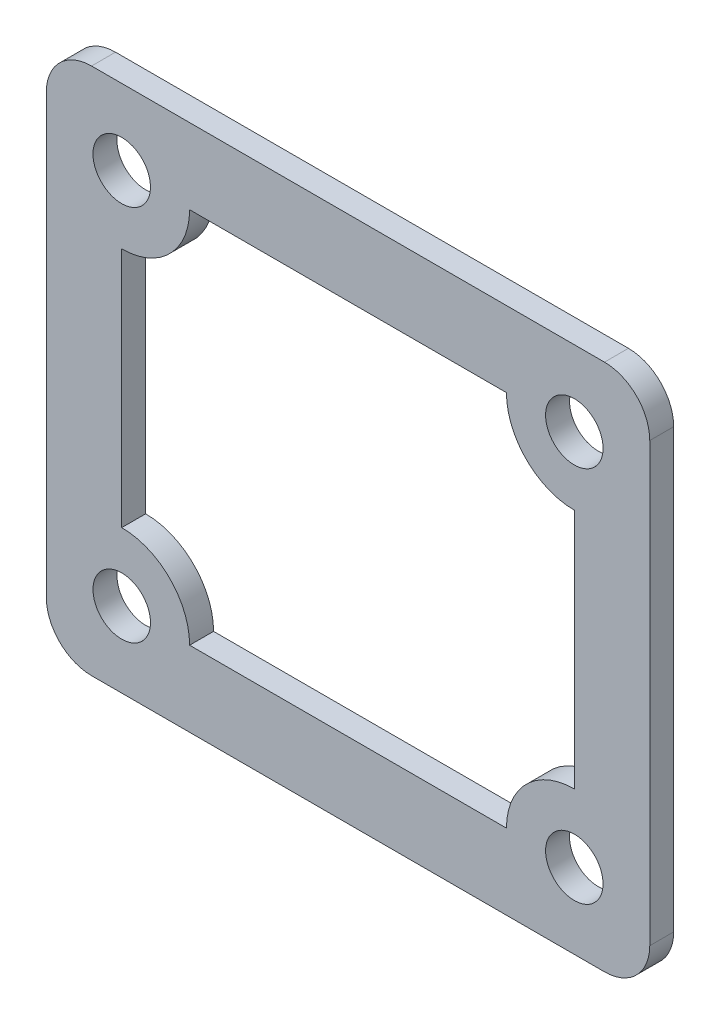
ISO-10303-21;
HEADER;
FILE_DESCRIPTION(('STEP AP214'),'2;1');
FILE_NAME('part.step','',(''),(''),'','','');
FILE_SCHEMA(('AUTOMOTIVE_DESIGN { 1 0 10303 214 1 1 1 1 }'));
ENDSEC;
DATA;
#1=APPLICATION_CONTEXT('core data for automotive mechanical design processes');
#2=APPLICATION_PROTOCOL_DEFINITION('international standard','automotive_design',2000,#1);
#3=PRODUCT_CONTEXT('',#1,'mechanical');
#4=PRODUCT('Part','Part','',(#3));
#5=PRODUCT_RELATED_PRODUCT_CATEGORY('part','',(#4));
#6=PRODUCT_DEFINITION_FORMATION('','',#4);
#7=PRODUCT_DEFINITION_CONTEXT('part definition',#1,'design');
#8=PRODUCT_DEFINITION('design','',#6,#7);
#9=PRODUCT_DEFINITION_SHAPE('','',#8);
#10=(LENGTH_UNIT() NAMED_UNIT(*) SI_UNIT(.MILLI.,.METRE.));
#11=(NAMED_UNIT(*) PLANE_ANGLE_UNIT() SI_UNIT($,.RADIAN.));
#12=(NAMED_UNIT(*) SI_UNIT($,.STERADIAN.) SOLID_ANGLE_UNIT());
#13=UNCERTAINTY_MEASURE_WITH_UNIT(LENGTH_MEASURE(1.E-05),#10,'distance_accuracy_value','');
#14=(GEOMETRIC_REPRESENTATION_CONTEXT(3) GLOBAL_UNCERTAINTY_ASSIGNED_CONTEXT((#13)) GLOBAL_UNIT_ASSIGNED_CONTEXT((#10,
#11,#12)) REPRESENTATION_CONTEXT('',''));
#15=CARTESIAN_POINT('',(0.,0.,0.));
#16=DIRECTION('',(0.,0.,1.));
#17=DIRECTION('',(1.,0.,0.));
#18=AXIS2_PLACEMENT_3D('',#15,#16,#17);
#19=CARTESIAN_POINT('',(0.,0.,1.5875));
#20=DIRECTION('',(0.,0.,1.));
#21=DIRECTION('',(1.,0.,0.));
#22=AXIS2_PLACEMENT_3D('',#19,#20,#21);
#23=PLANE('',#22);
#24=CARTESIAN_POINT('',(15.,12.5,1.5875));
#25=DIRECTION('',(0.,0.,1.));
#26=DIRECTION('',(1.,0.,0.));
#27=AXIS2_PLACEMENT_3D('',#24,#25,#26);
#28=CIRCLE('',#27,1.905);
#29=CARTESIAN_POINT('',(16.905,12.5,1.5875));
#30=VERTEX_POINT('',#29);
#31=EDGE_CURVE('E257',#30,#30,#28,.T.);
#32=ORIENTED_EDGE('',*,*,#31,.F.);
#33=EDGE_LOOP('',(#32));
#34=FACE_BOUND('',#33,.T.);
#35=CARTESIAN_POINT('',(15.,-12.5,1.5875));
#36=DIRECTION('',(0.,0.,1.));
#37=DIRECTION('',(-1.,0.,0.));
#38=AXIS2_PLACEMENT_3D('',#35,#36,#37);
#39=CIRCLE('',#38,1.905);
#40=CARTESIAN_POINT('',(13.095,-12.5,1.5875));
#41=VERTEX_POINT('',#40);
#42=EDGE_CURVE('E273',#41,#41,#39,.T.);
#43=ORIENTED_EDGE('',*,*,#42,.F.);
#44=EDGE_LOOP('',(#43));
#45=FACE_BOUND('',#44,.T.);
#46=DIRECTION('',(0.,1.,0.));
#47=VECTOR('',#46,1.);
#48=CARTESIAN_POINT('',(20.,17.5,1.5875));
#49=LINE('',#48,#47);
#50=CARTESIAN_POINT('',(20.,-14.5,1.5875));
#51=VERTEX_POINT('',#50);
#52=CARTESIAN_POINT('',(20.,14.5,1.5875));
#53=VERTEX_POINT('',#52);
#54=EDGE_CURVE('E281',#51,#53,#49,.T.);
#55=ORIENTED_EDGE('',*,*,#54,.T.);
#56=CARTESIAN_POINT('',(17.,14.5,1.5875));
#57=DIRECTION('',(0.,0.,1.));
#58=DIRECTION('',(1.,0.,0.));
#59=AXIS2_PLACEMENT_3D('',#56,#57,#58);
#60=CIRCLE('',#59,3.);
#61=CARTESIAN_POINT('',(17.,17.5,1.5875));
#62=VERTEX_POINT('',#61);
#63=EDGE_CURVE('E343',#53,#62,#60,.T.);
#64=ORIENTED_EDGE('',*,*,#63,.T.);
#65=DIRECTION('',(-1.,0.,0.));
#66=VECTOR('',#65,1.);
#67=CARTESIAN_POINT('',(-20.,17.5,1.5875));
#68=LINE('',#67,#66);
#69=CARTESIAN_POINT('',(-17.,17.5,1.5875));
#70=VERTEX_POINT('',#69);
#71=EDGE_CURVE('E285',#62,#70,#68,.T.);
#72=ORIENTED_EDGE('',*,*,#71,.T.);
#73=CARTESIAN_POINT('',(-17.,14.5,1.5875));
#74=DIRECTION('',(0.,0.,1.));
#75=DIRECTION('',(1.,0.,0.));
#76=AXIS2_PLACEMENT_3D('',#73,#74,#75);
#77=CIRCLE('',#76,3.);
#78=CARTESIAN_POINT('',(-20.,14.5,1.5875));
#79=VERTEX_POINT('',#78);
#80=EDGE_CURVE('E340',#70,#79,#77,.T.);
#81=ORIENTED_EDGE('',*,*,#80,.T.);
#82=DIRECTION('',(0.,-1.,0.));
#83=VECTOR('',#82,1.);
#84=CARTESIAN_POINT('',(-20.,17.5,1.5875));
#85=LINE('',#84,#83);
#86=CARTESIAN_POINT('',(-20.,-14.5,1.5875));
#87=VERTEX_POINT('',#86);
#88=EDGE_CURVE('E290',#79,#87,#85,.T.);
#89=ORIENTED_EDGE('',*,*,#88,.T.);
#90=CARTESIAN_POINT('',(-17.,-14.5,1.5875));
#91=DIRECTION('',(0.,0.,1.));
#92=DIRECTION('',(1.,0.,0.));
#93=AXIS2_PLACEMENT_3D('',#90,#91,#92);
#94=CIRCLE('',#93,3.);
#95=CARTESIAN_POINT('',(-17.,-17.5,1.5875));
#96=VERTEX_POINT('',#95);
#97=EDGE_CURVE('E61',#87,#96,#94,.T.);
#98=ORIENTED_EDGE('',*,*,#97,.T.);
#99=DIRECTION('',(1.,0.,0.));
#100=VECTOR('',#99,1.);
#101=CARTESIAN_POINT('',(-20.,-17.5,1.5875));
#102=LINE('',#101,#100);
#103=CARTESIAN_POINT('',(17.,-17.5,1.5875));
#104=VERTEX_POINT('',#103);
#105=EDGE_CURVE('E293',#96,#104,#102,.T.);
#106=ORIENTED_EDGE('',*,*,#105,.T.);
#107=CARTESIAN_POINT('',(17.,-14.5,1.5875));
#108=DIRECTION('',(0.,0.,1.));
#109=DIRECTION('',(1.,0.,0.));
#110=AXIS2_PLACEMENT_3D('',#107,#108,#109);
#111=CIRCLE('',#110,3.);
#112=EDGE_CURVE('E335',#104,#51,#111,.T.);
#113=ORIENTED_EDGE('',*,*,#112,.T.);
#114=EDGE_LOOP('',(#55,#64,#72,#81,#89,#98,#106,#113));
#115=FACE_BOUND('',#114,.T.);
#116=CARTESIAN_POINT('',(-15.,-12.5,1.5875));
#117=DIRECTION('',(0.,0.,1.));
#118=DIRECTION('',(1.,0.,0.));
#119=AXIS2_PLACEMENT_3D('',#116,#117,#118);
#120=CIRCLE('',#119,1.905);
#121=CARTESIAN_POINT('',(-13.095,-12.5,1.5875));
#122=VERTEX_POINT('',#121);
#123=EDGE_CURVE('E265',#122,#122,#120,.T.);
#124=ORIENTED_EDGE('',*,*,#123,.F.);
#125=EDGE_LOOP('',(#124));
#126=FACE_BOUND('',#125,.T.);
#127=CARTESIAN_POINT('',(-15.,12.5,1.5875));
#128=DIRECTION('',(0.,0.,1.));
#129=DIRECTION('',(-1.,0.,0.));
#130=AXIS2_PLACEMENT_3D('',#127,#128,#129);
#131=CIRCLE('',#130,1.905);
#132=CARTESIAN_POINT('',(-16.905,12.5,1.5875));
#133=VERTEX_POINT('',#132);
#134=EDGE_CURVE('E249',#133,#133,#131,.T.);
#135=ORIENTED_EDGE('',*,*,#134,.F.);
#136=EDGE_LOOP('',(#135));
#137=FACE_BOUND('',#136,.T.);
#138=DIRECTION('',(1.,0.,0.));
#139=VECTOR('',#138,1.);
#140=CARTESIAN_POINT('',(10.5,-12.5,1.5875));
#141=LINE('',#140,#139);
#142=CARTESIAN_POINT('',(-10.5,-12.5,1.5875));
#143=VERTEX_POINT('',#142);
#144=CARTESIAN_POINT('',(10.5,-12.5,1.5875));
#145=VERTEX_POINT('',#144);
#146=EDGE_CURVE('E166',#143,#145,#141,.T.);
#147=ORIENTED_EDGE('',*,*,#146,.F.);
#148=CARTESIAN_POINT('',(-15.,-12.5,1.5875));
#149=DIRECTION('',(0.,0.,-1.));
#150=DIRECTION('',(1.,0.,0.));
#151=AXIS2_PLACEMENT_3D('',#148,#149,#150);
#152=CIRCLE('',#151,4.5);
#153=CARTESIAN_POINT('',(-15.,-8.,1.5875));
#154=VERTEX_POINT('',#153);
#155=EDGE_CURVE('E155',#154,#143,#152,.T.);
#156=ORIENTED_EDGE('',*,*,#155,.F.);
#157=DIRECTION('',(0.,-1.,0.));
#158=VECTOR('',#157,1.);
#159=CARTESIAN_POINT('',(-15.,7.99999999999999,1.5875));
#160=LINE('',#159,#158);
#161=CARTESIAN_POINT('',(-15.,8.,1.5875));
#162=VERTEX_POINT('',#161);
#163=EDGE_CURVE('E199',#162,#154,#160,.T.);
#164=ORIENTED_EDGE('',*,*,#163,.F.);
#165=CARTESIAN_POINT('',(-15.,12.5,1.5875));
#166=DIRECTION('',(0.,0.,-1.));
#167=DIRECTION('',(-1.,0.,0.));
#168=AXIS2_PLACEMENT_3D('',#165,#166,#167);
#169=CIRCLE('',#168,4.5);
#170=CARTESIAN_POINT('',(-10.5,12.5,1.5875));
#171=VERTEX_POINT('',#170);
#172=EDGE_CURVE('E195',#171,#162,#169,.T.);
#173=ORIENTED_EDGE('',*,*,#172,.F.);
#174=DIRECTION('',(-1.,0.,0.));
#175=VECTOR('',#174,1.);
#176=CARTESIAN_POINT('',(10.5,12.5,1.5875));
#177=LINE('',#176,#175);
#178=CARTESIAN_POINT('',(10.5,12.5,1.5875));
#179=VERTEX_POINT('',#178);
#180=EDGE_CURVE('E192',#179,#171,#177,.T.);
#181=ORIENTED_EDGE('',*,*,#180,.F.);
#182=CARTESIAN_POINT('',(15.,12.5,1.5875));
#183=DIRECTION('',(0.,0.,-1.));
#184=DIRECTION('',(1.,0.,0.));
#185=AXIS2_PLACEMENT_3D('',#182,#183,#184);
#186=CIRCLE('',#185,4.5);
#187=CARTESIAN_POINT('',(15.,8.,1.5875));
#188=VERTEX_POINT('',#187);
#189=EDGE_CURVE('E189',#188,#179,#186,.T.);
#190=ORIENTED_EDGE('',*,*,#189,.F.);
#191=DIRECTION('',(0.,1.,0.));
#192=VECTOR('',#191,1.);
#193=CARTESIAN_POINT('',(15.,8.,1.5875));
#194=LINE('',#193,#192);
#195=CARTESIAN_POINT('',(15.,-8.00000000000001,1.5875));
#196=VERTEX_POINT('',#195);
#197=EDGE_CURVE('E184',#196,#188,#194,.T.);
#198=ORIENTED_EDGE('',*,*,#197,.F.);
#199=CARTESIAN_POINT('',(15.,-12.5,1.5875));
#200=DIRECTION('',(0.,0.,-1.));
#201=DIRECTION('',(-1.,0.,0.));
#202=AXIS2_PLACEMENT_3D('',#199,#200,#201);
#203=CIRCLE('',#202,4.5);
#204=EDGE_CURVE('E180',#145,#196,#203,.T.);
#205=ORIENTED_EDGE('',*,*,#204,.F.);
#206=EDGE_LOOP('',(#147,#156,#164,#173,#181,#190,#198,#205));
#207=FACE_BOUND('',#206,.T.);
#208=ADVANCED_FACE('F39',(#34,#45,#115,#126,#137,#207),#23,.T.);
#209=CARTESIAN_POINT('',(0.,0.,0.));
#210=DIRECTION('',(0.,0.,1.));
#211=DIRECTION('',(1.,0.,0.));
#212=AXIS2_PLACEMENT_3D('',#209,#210,#211);
#213=PLANE('',#212);
#214=CARTESIAN_POINT('',(-15.,12.5,0.));
#215=DIRECTION('',(0.,0.,1.));
#216=DIRECTION('',(-1.,0.,0.));
#217=AXIS2_PLACEMENT_3D('',#214,#215,#216);
#218=CIRCLE('',#217,1.905);
#219=CARTESIAN_POINT('',(-16.905,12.5,0.));
#220=VERTEX_POINT('',#219);
#221=EDGE_CURVE('E175',#220,#220,#218,.T.);
#222=ORIENTED_EDGE('',*,*,#221,.T.);
#223=EDGE_LOOP('',(#222));
#224=FACE_BOUND('',#223,.T.);
#225=CARTESIAN_POINT('',(15.,12.5,0.));
#226=DIRECTION('',(0.,0.,1.));
#227=DIRECTION('',(1.,0.,0.));
#228=AXIS2_PLACEMENT_3D('',#225,#226,#227);
#229=CIRCLE('',#228,1.905);
#230=CARTESIAN_POINT('',(16.905,12.5,0.));
#231=VERTEX_POINT('',#230);
#232=EDGE_CURVE('E253',#231,#231,#229,.T.);
#233=ORIENTED_EDGE('',*,*,#232,.T.);
#234=EDGE_LOOP('',(#233));
#235=FACE_BOUND('',#234,.T.);
#236=CARTESIAN_POINT('',(-15.,-12.5,0.));
#237=DIRECTION('',(0.,0.,1.));
#238=DIRECTION('',(1.,0.,0.));
#239=AXIS2_PLACEMENT_3D('',#236,#237,#238);
#240=CIRCLE('',#239,1.905);
#241=CARTESIAN_POINT('',(-13.095,-12.5,0.));
#242=VERTEX_POINT('',#241);
#243=EDGE_CURVE('E261',#242,#242,#240,.T.);
#244=ORIENTED_EDGE('',*,*,#243,.T.);
#245=EDGE_LOOP('',(#244));
#246=FACE_BOUND('',#245,.T.);
#247=CARTESIAN_POINT('',(15.,-12.5,0.));
#248=DIRECTION('',(0.,0.,1.));
#249=DIRECTION('',(-1.,0.,0.));
#250=AXIS2_PLACEMENT_3D('',#247,#248,#249);
#251=CIRCLE('',#250,1.905);
#252=CARTESIAN_POINT('',(13.095,-12.5,0.));
#253=VERTEX_POINT('',#252);
#254=EDGE_CURVE('E269',#253,#253,#251,.T.);
#255=ORIENTED_EDGE('',*,*,#254,.T.);
#256=EDGE_LOOP('',(#255));
#257=FACE_BOUND('',#256,.T.);
#258=DIRECTION('',(-1.,0.,0.));
#259=VECTOR('',#258,1.);
#260=CARTESIAN_POINT('',(-20.,17.5,0.));
#261=LINE('',#260,#259);
#262=CARTESIAN_POINT('',(17.,17.5,0.));
#263=VERTEX_POINT('',#262);
#264=CARTESIAN_POINT('',(-17.,17.5,0.));
#265=VERTEX_POINT('',#264);
#266=EDGE_CURVE('E300',#263,#265,#261,.T.);
#267=ORIENTED_EDGE('',*,*,#266,.F.);
#268=CARTESIAN_POINT('',(17.,14.5,0.));
#269=DIRECTION('',(0.,0.,1.));
#270=DIRECTION('',(1.,0.,0.));
#271=AXIS2_PLACEMENT_3D('',#268,#269,#270);
#272=CIRCLE('',#271,3.);
#273=CARTESIAN_POINT('',(20.,14.5,0.));
#274=VERTEX_POINT('',#273);
#275=EDGE_CURVE('E325',#263,#274,#272,.F.);
#276=ORIENTED_EDGE('',*,*,#275,.T.);
#277=DIRECTION('',(0.,1.,0.));
#278=VECTOR('',#277,1.);
#279=CARTESIAN_POINT('',(20.,17.5,0.));
#280=LINE('',#279,#278);
#281=CARTESIAN_POINT('',(20.,-14.5,0.));
#282=VERTEX_POINT('',#281);
#283=EDGE_CURVE('E277',#282,#274,#280,.T.);
#284=ORIENTED_EDGE('',*,*,#283,.F.);
#285=CARTESIAN_POINT('',(17.,-14.5,0.));
#286=DIRECTION('',(0.,0.,1.));
#287=DIRECTION('',(1.,0.,0.));
#288=AXIS2_PLACEMENT_3D('',#285,#286,#287);
#289=CIRCLE('',#288,3.);
#290=CARTESIAN_POINT('',(17.,-17.5,0.));
#291=VERTEX_POINT('',#290);
#292=EDGE_CURVE('E316',#282,#291,#289,.F.);
#293=ORIENTED_EDGE('',*,*,#292,.T.);
#294=DIRECTION('',(1.,0.,0.));
#295=VECTOR('',#294,1.);
#296=CARTESIAN_POINT('',(-20.,-17.5,0.));
#297=LINE('',#296,#295);
#298=CARTESIAN_POINT('',(-17.,-17.5,0.));
#299=VERTEX_POINT('',#298);
#300=EDGE_CURVE('E286',#299,#291,#297,.T.);
#301=ORIENTED_EDGE('',*,*,#300,.F.);
#302=CARTESIAN_POINT('',(-17.,-14.5,0.));
#303=DIRECTION('',(0.,0.,1.));
#304=DIRECTION('',(1.,0.,0.));
#305=AXIS2_PLACEMENT_3D('',#302,#303,#304);
#306=CIRCLE('',#305,3.);
#307=CARTESIAN_POINT('',(-20.,-14.5,0.));
#308=VERTEX_POINT('',#307);
#309=EDGE_CURVE('E319',#299,#308,#306,.F.);
#310=ORIENTED_EDGE('',*,*,#309,.T.);
#311=DIRECTION('',(0.,-1.,0.));
#312=VECTOR('',#311,1.);
#313=CARTESIAN_POINT('',(-20.,17.5,0.));
#314=LINE('',#313,#312);
#315=CARTESIAN_POINT('',(-20.,14.5,0.));
#316=VERTEX_POINT('',#315);
#317=EDGE_CURVE('E304',#316,#308,#314,.T.);
#318=ORIENTED_EDGE('',*,*,#317,.F.);
#319=CARTESIAN_POINT('',(-17.,14.5,0.));
#320=DIRECTION('',(0.,0.,1.));
#321=DIRECTION('',(1.,0.,0.));
#322=AXIS2_PLACEMENT_3D('',#319,#320,#321);
#323=CIRCLE('',#322,3.);
#324=EDGE_CURVE('E322',#316,#265,#323,.F.);
#325=ORIENTED_EDGE('',*,*,#324,.T.);
#326=EDGE_LOOP('',(#267,#276,#284,#293,#301,#310,#318,#325));
#327=FACE_BOUND('',#326,.T.);
#328=CARTESIAN_POINT('',(-15.,-12.5,0.));
#329=DIRECTION('',(0.,0.,-1.));
#330=DIRECTION('',(1.,0.,0.));
#331=AXIS2_PLACEMENT_3D('',#328,#329,#330);
#332=CIRCLE('',#331,4.5);
#333=CARTESIAN_POINT('',(-15.,-8.,0.));
#334=VERTEX_POINT('',#333);
#335=CARTESIAN_POINT('',(-10.5,-12.5,0.));
#336=VERTEX_POINT('',#335);
#337=EDGE_CURVE('E202',#334,#336,#332,.T.);
#338=ORIENTED_EDGE('',*,*,#337,.T.);
#339=DIRECTION('',(1.,0.,0.));
#340=VECTOR('',#339,1.);
#341=CARTESIAN_POINT('',(10.5,-12.5,0.));
#342=LINE('',#341,#340);
#343=CARTESIAN_POINT('',(10.5,-12.5,0.));
#344=VERTEX_POINT('',#343);
#345=EDGE_CURVE('E173',#336,#344,#342,.T.);
#346=ORIENTED_EDGE('',*,*,#345,.T.);
#347=CARTESIAN_POINT('',(15.,-12.5,0.));
#348=DIRECTION('',(0.,0.,-1.));
#349=DIRECTION('',(-1.,0.,0.));
#350=AXIS2_PLACEMENT_3D('',#347,#348,#349);
#351=CIRCLE('',#350,4.5);
#352=CARTESIAN_POINT('',(15.,-8.00000000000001,0.));
#353=VERTEX_POINT('',#352);
#354=EDGE_CURVE('E207',#344,#353,#351,.T.);
#355=ORIENTED_EDGE('',*,*,#354,.T.);
#356=DIRECTION('',(0.,1.,0.));
#357=VECTOR('',#356,1.);
#358=CARTESIAN_POINT('',(15.,8.,0.));
#359=LINE('',#358,#357);
#360=CARTESIAN_POINT('',(15.,8.,0.));
#361=VERTEX_POINT('',#360);
#362=EDGE_CURVE('E211',#353,#361,#359,.T.);
#363=ORIENTED_EDGE('',*,*,#362,.T.);
#364=CARTESIAN_POINT('',(15.,12.5,0.));
#365=DIRECTION('',(0.,0.,-1.));
#366=DIRECTION('',(1.,0.,0.));
#367=AXIS2_PLACEMENT_3D('',#364,#365,#366);
#368=CIRCLE('',#367,4.5);
#369=CARTESIAN_POINT('',(10.5,12.5,0.));
#370=VERTEX_POINT('',#369);
#371=EDGE_CURVE('E215',#361,#370,#368,.T.);
#372=ORIENTED_EDGE('',*,*,#371,.T.);
#373=DIRECTION('',(-1.,0.,0.));
#374=VECTOR('',#373,1.);
#375=CARTESIAN_POINT('',(10.5,12.5,0.));
#376=LINE('',#375,#374);
#377=CARTESIAN_POINT('',(-10.5,12.5,0.));
#378=VERTEX_POINT('',#377);
#379=EDGE_CURVE('E219',#370,#378,#376,.T.);
#380=ORIENTED_EDGE('',*,*,#379,.T.);
#381=CARTESIAN_POINT('',(-15.,12.5,0.));
#382=DIRECTION('',(0.,0.,-1.));
#383=DIRECTION('',(-1.,0.,0.));
#384=AXIS2_PLACEMENT_3D('',#381,#382,#383);
#385=CIRCLE('',#384,4.5);
#386=CARTESIAN_POINT('',(-15.,8.,0.));
#387=VERTEX_POINT('',#386);
#388=EDGE_CURVE('E223',#378,#387,#385,.T.);
#389=ORIENTED_EDGE('',*,*,#388,.T.);
#390=DIRECTION('',(0.,-1.,0.));
#391=VECTOR('',#390,1.);
#392=CARTESIAN_POINT('',(-15.,7.99999999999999,0.));
#393=LINE('',#392,#391);
#394=EDGE_CURVE('E167',#387,#334,#393,.T.);
#395=ORIENTED_EDGE('',*,*,#394,.T.);
#396=EDGE_LOOP('',(#338,#346,#355,#363,#372,#380,#389,#395));
#397=FACE_BOUND('',#396,.T.);
#398=ADVANCED_FACE('F363',(#224,#235,#246,#257,#327,#397),#213,.F.);
#399=CARTESIAN_POINT('',(20.,17.5,1.5875));
#400=DIRECTION('',(-1.,0.,0.));
#401=DIRECTION('',(0.,0.,1.));
#402=AXIS2_PLACEMENT_3D('',#399,#400,#401);
#403=PLANE('',#402);
#404=ORIENTED_EDGE('',*,*,#283,.T.);
#405=DIRECTION('',(0.,0.,-1.));
#406=VECTOR('',#405,1.);
#407=CARTESIAN_POINT('',(20.,14.5,1.5875));
#408=LINE('',#407,#406);
#409=EDGE_CURVE('E332',#274,#53,#408,.F.);
#410=ORIENTED_EDGE('',*,*,#409,.T.);
#411=ORIENTED_EDGE('',*,*,#54,.F.);
#412=DIRECTION('',(0.,0.,-1.));
#413=VECTOR('',#412,1.);
#414=CARTESIAN_POINT('',(20.,-14.5,1.5875));
#415=LINE('',#414,#413);
#416=EDGE_CURVE('E328',#51,#282,#415,.T.);
#417=ORIENTED_EDGE('',*,*,#416,.T.);
#418=EDGE_LOOP('',(#404,#410,#411,#417));
#419=FACE_BOUND('',#418,.T.);
#420=ADVANCED_FACE('F377',(#419),#403,.F.);
#421=CARTESIAN_POINT('',(-20.,17.5,1.5875));
#422=DIRECTION('',(0.,-1.,0.));
#423=DIRECTION('',(0.,0.,-1.));
#424=AXIS2_PLACEMENT_3D('',#421,#422,#423);
#425=PLANE('',#424);
#426=ORIENTED_EDGE('',*,*,#71,.F.);
#427=DIRECTION('',(0.,0.,-1.));
#428=VECTOR('',#427,1.);
#429=CARTESIAN_POINT('',(17.,17.5,1.5875));
#430=LINE('',#429,#428);
#431=EDGE_CURVE('E312',#62,#263,#430,.T.);
#432=ORIENTED_EDGE('',*,*,#431,.T.);
#433=ORIENTED_EDGE('',*,*,#266,.T.);
#434=DIRECTION('',(0.,0.,-1.));
#435=VECTOR('',#434,1.);
#436=CARTESIAN_POINT('',(-17.,17.5,1.5875));
#437=LINE('',#436,#435);
#438=EDGE_CURVE('E296',#265,#70,#437,.F.);
#439=ORIENTED_EDGE('',*,*,#438,.T.);
#440=EDGE_LOOP('',(#426,#432,#433,#439));
#441=FACE_BOUND('',#440,.T.);
#442=ADVANCED_FACE('F385',(#441),#425,.F.);
#443=CARTESIAN_POINT('',(-20.,17.5,1.5875));
#444=DIRECTION('',(1.,0.,0.));
#445=DIRECTION('',(0.,1.,0.));
#446=AXIS2_PLACEMENT_3D('',#443,#444,#445);
#447=PLANE('',#446);
#448=ORIENTED_EDGE('',*,*,#88,.F.);
#449=DIRECTION('',(0.,0.,-1.));
#450=VECTOR('',#449,1.);
#451=CARTESIAN_POINT('',(-20.,14.5,1.5875));
#452=LINE('',#451,#450);
#453=EDGE_CURVE('E349',#79,#316,#452,.T.);
#454=ORIENTED_EDGE('',*,*,#453,.T.);
#455=ORIENTED_EDGE('',*,*,#317,.T.);
#456=DIRECTION('',(0.,0.,-1.));
#457=VECTOR('',#456,1.);
#458=CARTESIAN_POINT('',(-20.,-14.5,1.5875));
#459=LINE('',#458,#457);
#460=EDGE_CURVE('E346',#308,#87,#459,.F.);
#461=ORIENTED_EDGE('',*,*,#460,.T.);
#462=EDGE_LOOP('',(#448,#454,#455,#461));
#463=FACE_BOUND('',#462,.T.);
#464=ADVANCED_FACE('F357',(#463),#447,.F.);
#465=CARTESIAN_POINT('',(-20.,-17.5,1.5875));
#466=DIRECTION('',(0.,1.,0.));
#467=DIRECTION('',(0.,0.,1.));
#468=AXIS2_PLACEMENT_3D('',#465,#466,#467);
#469=PLANE('',#468);
#470=ORIENTED_EDGE('',*,*,#105,.F.);
#471=DIRECTION('',(0.,0.,-1.));
#472=VECTOR('',#471,1.);
#473=CARTESIAN_POINT('',(-17.,-17.5,1.5875));
#474=LINE('',#473,#472);
#475=EDGE_CURVE('E11',#96,#299,#474,.T.);
#476=ORIENTED_EDGE('',*,*,#475,.T.);
#477=ORIENTED_EDGE('',*,*,#300,.T.);
#478=DIRECTION('',(0.,0.,-1.));
#479=VECTOR('',#478,1.);
#480=CARTESIAN_POINT('',(17.,-17.5,1.5875));
#481=LINE('',#480,#479);
#482=EDGE_CURVE('E48',#291,#104,#481,.F.);
#483=ORIENTED_EDGE('',*,*,#482,.T.);
#484=EDGE_LOOP('',(#470,#476,#477,#483));
#485=FACE_BOUND('',#484,.T.);
#486=ADVANCED_FACE('F369',(#485),#469,.F.);
#487=CARTESIAN_POINT('',(15.,-12.5,1.5875));
#488=DIRECTION('',(0.,0.,-1.));
#489=DIRECTION('',(-1.,0.,0.));
#490=AXIS2_PLACEMENT_3D('',#487,#488,#489);
#491=CYLINDRICAL_SURFACE('',#490,1.905);
#492=ORIENTED_EDGE('',*,*,#42,.T.);
#493=EDGE_LOOP('',(#492));
#494=FACE_BOUND('',#493,.T.);
#495=ORIENTED_EDGE('',*,*,#254,.F.);
#496=EDGE_LOOP('',(#495));
#497=FACE_BOUND('',#496,.T.);
#498=ADVANCED_FACE('F407',(#494,#497),#491,.F.);
#499=CARTESIAN_POINT('',(-15.,-12.5,1.5875));
#500=DIRECTION('',(0.,0.,-1.));
#501=DIRECTION('',(-1.,0.,0.));
#502=AXIS2_PLACEMENT_3D('',#499,#500,#501);
#503=CYLINDRICAL_SURFACE('',#502,1.905);
#504=ORIENTED_EDGE('',*,*,#123,.T.);
#505=EDGE_LOOP('',(#504));
#506=FACE_BOUND('',#505,.T.);
#507=ORIENTED_EDGE('',*,*,#243,.F.);
#508=EDGE_LOOP('',(#507));
#509=FACE_BOUND('',#508,.T.);
#510=ADVANCED_FACE('F440',(#506,#509),#503,.F.);
#511=CARTESIAN_POINT('',(15.,12.5,1.5875));
#512=DIRECTION('',(0.,0.,-1.));
#513=DIRECTION('',(-1.,0.,0.));
#514=AXIS2_PLACEMENT_3D('',#511,#512,#513);
#515=CYLINDRICAL_SURFACE('',#514,1.905);
#516=ORIENTED_EDGE('',*,*,#31,.T.);
#517=EDGE_LOOP('',(#516));
#518=FACE_BOUND('',#517,.T.);
#519=ORIENTED_EDGE('',*,*,#232,.F.);
#520=EDGE_LOOP('',(#519));
#521=FACE_BOUND('',#520,.T.);
#522=ADVANCED_FACE('F447',(#518,#521),#515,.F.);
#523=CARTESIAN_POINT('',(-15.,12.5,1.5875));
#524=DIRECTION('',(0.,0.,-1.));
#525=DIRECTION('',(-1.,0.,0.));
#526=AXIS2_PLACEMENT_3D('',#523,#524,#525);
#527=CYLINDRICAL_SURFACE('',#526,1.905);
#528=ORIENTED_EDGE('',*,*,#134,.T.);
#529=EDGE_LOOP('',(#528));
#530=FACE_BOUND('',#529,.T.);
#531=ORIENTED_EDGE('',*,*,#221,.F.);
#532=EDGE_LOOP('',(#531));
#533=FACE_BOUND('',#532,.T.);
#534=ADVANCED_FACE('F454',(#530,#533),#527,.F.);
#535=CARTESIAN_POINT('',(-15.,-12.5,1.5875));
#536=DIRECTION('',(0.,0.,-1.));
#537=DIRECTION('',(-1.,0.,0.));
#538=AXIS2_PLACEMENT_3D('',#535,#536,#537);
#539=CYLINDRICAL_SURFACE('',#538,4.5);
#540=ORIENTED_EDGE('',*,*,#337,.F.);
#541=DIRECTION('',(0.,0.,-1.));
#542=VECTOR('',#541,1.);
#543=CARTESIAN_POINT('',(-15.,-8.,1.5875));
#544=LINE('',#543,#542);
#545=EDGE_CURVE('E161',#154,#334,#544,.T.);
#546=ORIENTED_EDGE('',*,*,#545,.F.);
#547=ORIENTED_EDGE('',*,*,#155,.T.);
#548=DIRECTION('',(0.,0.,-1.));
#549=VECTOR('',#548,1.);
#550=CARTESIAN_POINT('',(-10.5,-12.5,1.5875));
#551=LINE('',#550,#549);
#552=EDGE_CURVE('E158',#143,#336,#551,.T.);
#553=ORIENTED_EDGE('',*,*,#552,.T.);
#554=EDGE_LOOP('',(#540,#546,#547,#553));
#555=FACE_BOUND('',#554,.T.);
#556=ADVANCED_FACE('F157',(#555),#539,.T.);
#557=CARTESIAN_POINT('',(10.5,-12.5,1.5875));
#558=DIRECTION('',(0.,1.,0.));
#559=DIRECTION('',(-1.,0.,0.));
#560=AXIS2_PLACEMENT_3D('',#557,#558,#559);
#561=PLANE('',#560);
#562=ORIENTED_EDGE('',*,*,#345,.F.);
#563=ORIENTED_EDGE('',*,*,#552,.F.);
#564=ORIENTED_EDGE('',*,*,#146,.T.);
#565=DIRECTION('',(0.,0.,-1.));
#566=VECTOR('',#565,1.);
#567=CARTESIAN_POINT('',(10.5,-12.5,1.5875));
#568=LINE('',#567,#566);
#569=EDGE_CURVE('E176',#145,#344,#568,.T.);
#570=ORIENTED_EDGE('',*,*,#569,.T.);
#571=EDGE_LOOP('',(#562,#563,#564,#570));
#572=FACE_BOUND('',#571,.T.);
#573=ADVANCED_FACE('F170',(#572),#561,.T.);
#574=CARTESIAN_POINT('',(15.,-12.5,1.5875));
#575=DIRECTION('',(0.,0.,-1.));
#576=DIRECTION('',(-1.,0.,0.));
#577=AXIS2_PLACEMENT_3D('',#574,#575,#576);
#578=CYLINDRICAL_SURFACE('',#577,4.5);
#579=ORIENTED_EDGE('',*,*,#354,.F.);
#580=ORIENTED_EDGE('',*,*,#569,.F.);
#581=ORIENTED_EDGE('',*,*,#204,.T.);
#582=DIRECTION('',(0.,0.,-1.));
#583=VECTOR('',#582,1.);
#584=CARTESIAN_POINT('',(15.,-8.00000000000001,1.5875));
#585=LINE('',#584,#583);
#586=EDGE_CURVE('E244',#196,#353,#585,.T.);
#587=ORIENTED_EDGE('',*,*,#586,.T.);
#588=EDGE_LOOP('',(#579,#580,#581,#587));
#589=FACE_BOUND('',#588,.T.);
#590=ADVANCED_FACE('F475',(#589),#578,.T.);
#591=CARTESIAN_POINT('',(15.,8.,1.5875));
#592=DIRECTION('',(-1.,0.,0.));
#593=DIRECTION('',(0.,-1.,0.));
#594=AXIS2_PLACEMENT_3D('',#591,#592,#593);
#595=PLANE('',#594);
#596=ORIENTED_EDGE('',*,*,#362,.F.);
#597=ORIENTED_EDGE('',*,*,#586,.F.);
#598=ORIENTED_EDGE('',*,*,#197,.T.);
#599=DIRECTION('',(0.,0.,-1.));
#600=VECTOR('',#599,1.);
#601=CARTESIAN_POINT('',(15.,8.,1.5875));
#602=LINE('',#601,#600);
#603=EDGE_CURVE('E241',#188,#361,#602,.T.);
#604=ORIENTED_EDGE('',*,*,#603,.T.);
#605=EDGE_LOOP('',(#596,#597,#598,#604));
#606=FACE_BOUND('',#605,.T.);
#607=ADVANCED_FACE('F482',(#606),#595,.T.);
#608=CARTESIAN_POINT('',(15.,12.5,1.5875));
#609=DIRECTION('',(0.,0.,-1.));
#610=DIRECTION('',(-1.,0.,0.));
#611=AXIS2_PLACEMENT_3D('',#608,#609,#610);
#612=CYLINDRICAL_SURFACE('',#611,4.5);
#613=ORIENTED_EDGE('',*,*,#371,.F.);
#614=ORIENTED_EDGE('',*,*,#603,.F.);
#615=ORIENTED_EDGE('',*,*,#189,.T.);
#616=DIRECTION('',(0.,0.,-1.));
#617=VECTOR('',#616,1.);
#618=CARTESIAN_POINT('',(10.5,12.5,1.5875));
#619=LINE('',#618,#617);
#620=EDGE_CURVE('E238',#179,#370,#619,.T.);
#621=ORIENTED_EDGE('',*,*,#620,.T.);
#622=EDGE_LOOP('',(#613,#614,#615,#621));
#623=FACE_BOUND('',#622,.T.);
#624=ADVANCED_FACE('F490',(#623),#612,.T.);
#625=CARTESIAN_POINT('',(10.5,12.5,1.5875));
#626=DIRECTION('',(0.,-1.,0.));
#627=DIRECTION('',(1.,0.,0.));
#628=AXIS2_PLACEMENT_3D('',#625,#626,#627);
#629=PLANE('',#628);
#630=ORIENTED_EDGE('',*,*,#379,.F.);
#631=ORIENTED_EDGE('',*,*,#620,.F.);
#632=ORIENTED_EDGE('',*,*,#180,.T.);
#633=DIRECTION('',(0.,0.,-1.));
#634=VECTOR('',#633,1.);
#635=CARTESIAN_POINT('',(-10.5,12.5,1.5875));
#636=LINE('',#635,#634);
#637=EDGE_CURVE('E235',#171,#378,#636,.T.);
#638=ORIENTED_EDGE('',*,*,#637,.T.);
#639=EDGE_LOOP('',(#630,#631,#632,#638));
#640=FACE_BOUND('',#639,.T.);
#641=ADVANCED_FACE('F498',(#640),#629,.T.);
#642=CARTESIAN_POINT('',(-15.,12.5,1.5875));
#643=DIRECTION('',(0.,0.,-1.));
#644=DIRECTION('',(-1.,0.,0.));
#645=AXIS2_PLACEMENT_3D('',#642,#643,#644);
#646=CYLINDRICAL_SURFACE('',#645,4.5);
#647=ORIENTED_EDGE('',*,*,#388,.F.);
#648=ORIENTED_EDGE('',*,*,#637,.F.);
#649=ORIENTED_EDGE('',*,*,#172,.T.);
#650=DIRECTION('',(0.,0.,-1.));
#651=VECTOR('',#650,1.);
#652=CARTESIAN_POINT('',(-15.,8.,1.5875));
#653=LINE('',#652,#651);
#654=EDGE_CURVE('E232',#162,#387,#653,.T.);
#655=ORIENTED_EDGE('',*,*,#654,.T.);
#656=EDGE_LOOP('',(#647,#648,#649,#655));
#657=FACE_BOUND('',#656,.T.);
#658=ADVANCED_FACE('F506',(#657),#646,.T.);
#659=CARTESIAN_POINT('',(-15.,7.99999999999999,1.5875));
#660=DIRECTION('',(1.,0.,0.));
#661=DIRECTION('',(0.,1.,0.));
#662=AXIS2_PLACEMENT_3D('',#659,#660,#661);
#663=PLANE('',#662);
#664=ORIENTED_EDGE('',*,*,#394,.F.);
#665=ORIENTED_EDGE('',*,*,#654,.F.);
#666=ORIENTED_EDGE('',*,*,#163,.T.);
#667=ORIENTED_EDGE('',*,*,#545,.T.);
#668=EDGE_LOOP('',(#664,#665,#666,#667));
#669=FACE_BOUND('',#668,.T.);
#670=ADVANCED_FACE('F394',(#669),#663,.T.);
#671=CARTESIAN_POINT('',(17.,14.5,1.5875));
#672=DIRECTION('',(0.,0.,-1.));
#673=DIRECTION('',(-1.,0.,0.));
#674=AXIS2_PLACEMENT_3D('',#671,#672,#673);
#675=CYLINDRICAL_SURFACE('',#674,3.);
#676=ORIENTED_EDGE('',*,*,#63,.F.);
#677=ORIENTED_EDGE('',*,*,#409,.F.);
#678=ORIENTED_EDGE('',*,*,#275,.F.);
#679=ORIENTED_EDGE('',*,*,#431,.F.);
#680=EDGE_LOOP('',(#676,#677,#678,#679));
#681=FACE_BOUND('',#680,.T.);
#682=ADVANCED_FACE('F382',(#681),#675,.T.);
#683=CARTESIAN_POINT('',(-17.,14.5,1.5875));
#684=DIRECTION('',(0.,0.,-1.));
#685=DIRECTION('',(-1.,0.,0.));
#686=AXIS2_PLACEMENT_3D('',#683,#684,#685);
#687=CYLINDRICAL_SURFACE('',#686,3.);
#688=ORIENTED_EDGE('',*,*,#80,.F.);
#689=ORIENTED_EDGE('',*,*,#438,.F.);
#690=ORIENTED_EDGE('',*,*,#324,.F.);
#691=ORIENTED_EDGE('',*,*,#453,.F.);
#692=EDGE_LOOP('',(#688,#689,#690,#691));
#693=FACE_BOUND('',#692,.T.);
#694=ADVANCED_FACE('F387',(#693),#687,.T.);
#695=CARTESIAN_POINT('',(-17.,-14.5,1.5875));
#696=DIRECTION('',(0.,0.,-1.));
#697=DIRECTION('',(-1.,0.,0.));
#698=AXIS2_PLACEMENT_3D('',#695,#696,#697);
#699=CYLINDRICAL_SURFACE('',#698,3.);
#700=ORIENTED_EDGE('',*,*,#97,.F.);
#701=ORIENTED_EDGE('',*,*,#460,.F.);
#702=ORIENTED_EDGE('',*,*,#309,.F.);
#703=ORIENTED_EDGE('',*,*,#475,.F.);
#704=EDGE_LOOP('',(#700,#701,#702,#703));
#705=FACE_BOUND('',#704,.T.);
#706=ADVANCED_FACE('F368',(#705),#699,.T.);
#707=CARTESIAN_POINT('',(17.,-14.5,1.5875));
#708=DIRECTION('',(0.,0.,-1.));
#709=DIRECTION('',(-1.,0.,0.));
#710=AXIS2_PLACEMENT_3D('',#707,#708,#709);
#711=CYLINDRICAL_SURFACE('',#710,3.);
#712=ORIENTED_EDGE('',*,*,#112,.F.);
#713=ORIENTED_EDGE('',*,*,#482,.F.);
#714=ORIENTED_EDGE('',*,*,#292,.F.);
#715=ORIENTED_EDGE('',*,*,#416,.F.);
#716=EDGE_LOOP('',(#712,#713,#714,#715));
#717=FACE_BOUND('',#716,.T.);
#718=ADVANCED_FACE('F41',(#717),#711,.T.);
#719=CLOSED_SHELL('',(#208,#398,#420,#442,#464,#486,#498,#510,#522,#534,#556,#573,#590,#607,
#624,#641,#658,#670,#682,#694,#706,#718));
#720=MANIFOLD_SOLID_BREP('B2',#719);
#721=ADVANCED_BREP_SHAPE_REPRESENTATION('',(#18,#720),#14);
#722=SHAPE_DEFINITION_REPRESENTATION(#9,#721);
ENDSEC;
END-ISO-10303-21;
